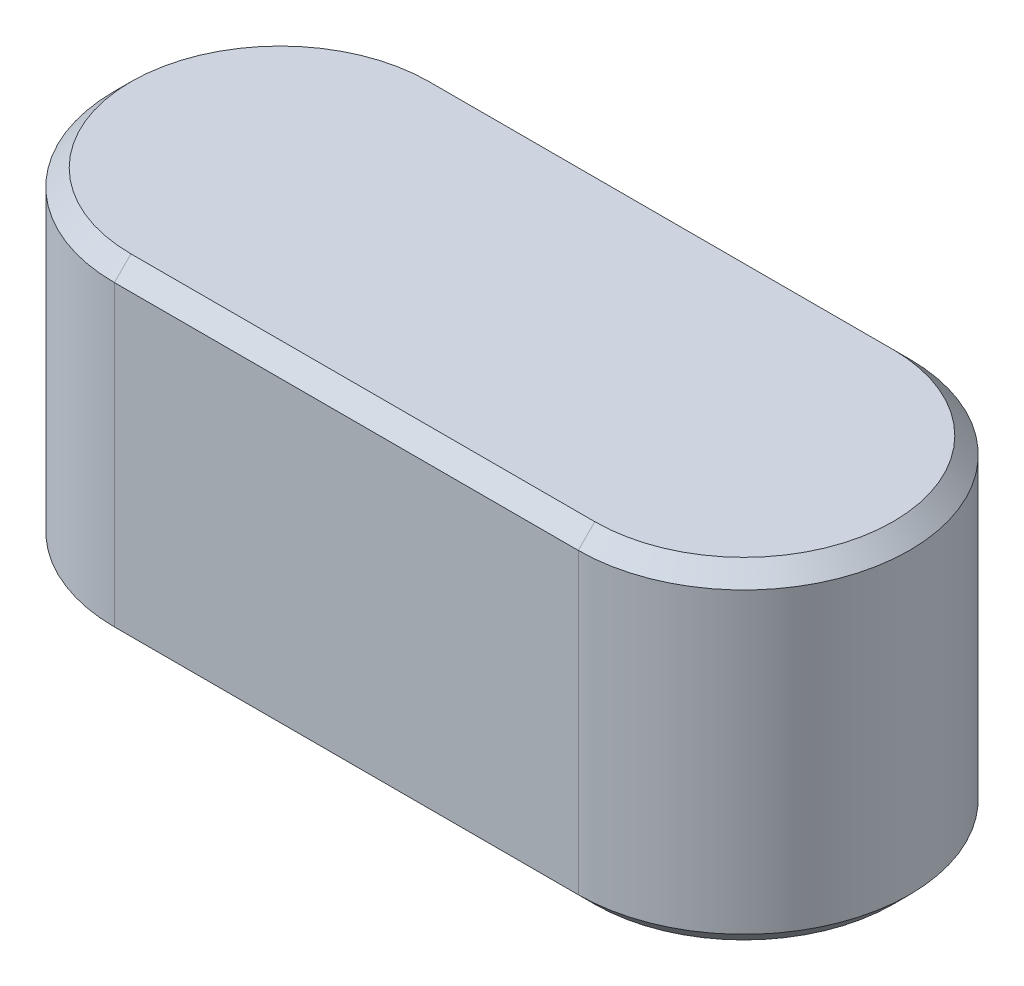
ISO-10303-21;
HEADER;
FILE_DESCRIPTION(('STEP AP214'),'2;1');
FILE_NAME('part.step','',(''),(''),'','','');
FILE_SCHEMA(('AUTOMOTIVE_DESIGN { 1 0 10303 214 1 1 1 1 }'));
ENDSEC;
DATA;
#1=APPLICATION_CONTEXT('core data for automotive mechanical design processes');
#2=APPLICATION_PROTOCOL_DEFINITION('international standard','automotive_design',2000,#1);
#3=PRODUCT_CONTEXT('',#1,'mechanical');
#4=PRODUCT('Part','Part','',(#3));
#5=PRODUCT_RELATED_PRODUCT_CATEGORY('part','',(#4));
#6=PRODUCT_DEFINITION_FORMATION('','',#4);
#7=PRODUCT_DEFINITION_CONTEXT('part definition',#1,'design');
#8=PRODUCT_DEFINITION('design','',#6,#7);
#9=PRODUCT_DEFINITION_SHAPE('','',#8);
#10=(LENGTH_UNIT() NAMED_UNIT(*) SI_UNIT(.MILLI.,.METRE.));
#11=(NAMED_UNIT(*) PLANE_ANGLE_UNIT() SI_UNIT($,.RADIAN.));
#12=(NAMED_UNIT(*) SI_UNIT($,.STERADIAN.) SOLID_ANGLE_UNIT());
#13=UNCERTAINTY_MEASURE_WITH_UNIT(LENGTH_MEASURE(1.E-05),#10,'distance_accuracy_value','');
#14=(GEOMETRIC_REPRESENTATION_CONTEXT(3) GLOBAL_UNCERTAINTY_ASSIGNED_CONTEXT((#13)) GLOBAL_UNIT_ASSIGNED_CONTEXT((#10,
#11,#12)) REPRESENTATION_CONTEXT('',''));
#15=CARTESIAN_POINT('',(0.,0.,0.));
#16=DIRECTION('',(0.,0.,1.));
#17=DIRECTION('',(1.,0.,0.));
#18=AXIS2_PLACEMENT_3D('',#15,#16,#17);
#19=CARTESIAN_POINT('',(0.,5.,0.));
#20=DIRECTION('',(0.,-1.,0.));
#21=DIRECTION('',(0.,0.,-1.));
#22=AXIS2_PLACEMENT_3D('',#19,#20,#21);
#23=CYLINDRICAL_SURFACE('',#22,2.5);
#24=DIRECTION('',(0.,-1.,0.));
#25=VECTOR('',#24,1.);
#26=CARTESIAN_POINT('',(0.,5.,2.5));
#27=LINE('',#26,#25);
#28=CARTESIAN_POINT('',(0.,4.75,2.5));
#29=VERTEX_POINT('',#28);
#30=CARTESIAN_POINT('',(0.,0.250000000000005,2.5));
#31=VERTEX_POINT('',#30);
#32=EDGE_CURVE('E102',#29,#31,#27,.T.);
#33=ORIENTED_EDGE('',*,*,#32,.F.);
#34=CARTESIAN_POINT('',(0.,4.75,0.));
#35=DIRECTION('',(0.,1.,0.));
#36=DIRECTION('',(0.,0.,1.));
#37=AXIS2_PLACEMENT_3D('',#34,#35,#36);
#38=CIRCLE('',#37,2.5);
#39=CARTESIAN_POINT('',(0.,4.75,-2.5));
#40=VERTEX_POINT('',#39);
#41=EDGE_CURVE('E99',#29,#40,#38,.F.);
#42=ORIENTED_EDGE('',*,*,#41,.T.);
#43=DIRECTION('',(0.,-1.,0.));
#44=VECTOR('',#43,1.);
#45=CARTESIAN_POINT('',(0.,5.,-2.5));
#46=LINE('',#45,#44);
#47=CARTESIAN_POINT('',(0.,0.250000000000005,-2.5));
#48=VERTEX_POINT('',#47);
#49=EDGE_CURVE('E101',#40,#48,#46,.T.);
#50=ORIENTED_EDGE('',*,*,#49,.T.);
#51=CARTESIAN_POINT('',(0.,0.250000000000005,0.));
#52=DIRECTION('',(0.,1.,0.));
#53=DIRECTION('',(0.,0.,1.));
#54=AXIS2_PLACEMENT_3D('',#51,#52,#53);
#55=CIRCLE('',#54,2.5);
#56=EDGE_CURVE('E49',#48,#31,#55,.T.);
#57=ORIENTED_EDGE('',*,*,#56,.T.);
#58=EDGE_LOOP('',(#33,#42,#50,#57));
#59=FACE_BOUND('',#58,.T.);
#60=ADVANCED_FACE('F35',(#59),#23,.T.);
#61=CARTESIAN_POINT('',(7.,5.,2.5));
#62=DIRECTION('',(0.,0.,-1.));
#63=DIRECTION('',(-1.,0.,0.));
#64=AXIS2_PLACEMENT_3D('',#61,#62,#63);
#65=PLANE('',#64);
#66=DIRECTION('',(0.,-1.,0.));
#67=VECTOR('',#66,1.);
#68=CARTESIAN_POINT('',(7.,5.,2.5));
#69=LINE('',#68,#67);
#70=CARTESIAN_POINT('',(7.,4.75,2.5));
#71=VERTEX_POINT('',#70);
#72=CARTESIAN_POINT('',(7.,0.250000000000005,2.5));
#73=VERTEX_POINT('',#72);
#74=EDGE_CURVE('E146',#71,#73,#69,.T.);
#75=ORIENTED_EDGE('',*,*,#74,.F.);
#76=DIRECTION('',(-1.,0.,0.));
#77=VECTOR('',#76,1.);
#78=CARTESIAN_POINT('',(0.,4.75,2.5));
#79=LINE('',#78,#77);
#80=EDGE_CURVE('E170',#71,#29,#79,.T.);
#81=ORIENTED_EDGE('',*,*,#80,.T.);
#82=ORIENTED_EDGE('',*,*,#32,.T.);
#83=DIRECTION('',(1.,0.,0.));
#84=VECTOR('',#83,1.);
#85=CARTESIAN_POINT('',(7.,0.250000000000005,2.5));
#86=LINE('',#85,#84);
#87=EDGE_CURVE('E168',#31,#73,#86,.T.);
#88=ORIENTED_EDGE('',*,*,#87,.T.);
#89=EDGE_LOOP('',(#75,#81,#82,#88));
#90=FACE_BOUND('',#89,.T.);
#91=ADVANCED_FACE('F194',(#90),#65,.F.);
#92=CARTESIAN_POINT('',(7.,5.,0.));
#93=DIRECTION('',(0.,-1.,0.));
#94=DIRECTION('',(0.,0.,-1.));
#95=AXIS2_PLACEMENT_3D('',#92,#93,#94);
#96=CYLINDRICAL_SURFACE('',#95,2.5);
#97=DIRECTION('',(0.,-1.,0.));
#98=VECTOR('',#97,1.);
#99=CARTESIAN_POINT('',(7.,5.,-2.5));
#100=LINE('',#99,#98);
#101=CARTESIAN_POINT('',(7.,4.75,-2.5));
#102=VERTEX_POINT('',#101);
#103=CARTESIAN_POINT('',(7.,0.250000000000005,-2.5));
#104=VERTEX_POINT('',#103);
#105=EDGE_CURVE('E116',#102,#104,#100,.T.);
#106=ORIENTED_EDGE('',*,*,#105,.F.);
#107=CARTESIAN_POINT('',(7.,4.75,0.));
#108=DIRECTION('',(0.,1.,0.));
#109=DIRECTION('',(0.,0.,1.));
#110=AXIS2_PLACEMENT_3D('',#107,#108,#109);
#111=CIRCLE('',#110,2.5);
#112=EDGE_CURVE('E11',#102,#71,#111,.F.);
#113=ORIENTED_EDGE('',*,*,#112,.T.);
#114=ORIENTED_EDGE('',*,*,#74,.T.);
#115=CARTESIAN_POINT('',(7.,0.250000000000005,0.));
#116=DIRECTION('',(0.,1.,0.));
#117=DIRECTION('',(0.,0.,1.));
#118=AXIS2_PLACEMENT_3D('',#115,#116,#117);
#119=CIRCLE('',#118,2.5);
#120=EDGE_CURVE('E42',#73,#104,#119,.T.);
#121=ORIENTED_EDGE('',*,*,#120,.T.);
#122=EDGE_LOOP('',(#106,#113,#114,#121));
#123=FACE_BOUND('',#122,.T.);
#124=ADVANCED_FACE('F174',(#123),#96,.T.);
#125=CARTESIAN_POINT('',(7.,5.,-2.5));
#126=DIRECTION('',(0.,0.,1.));
#127=DIRECTION('',(1.,0.,0.));
#128=AXIS2_PLACEMENT_3D('',#125,#126,#127);
#129=PLANE('',#128);
#130=ORIENTED_EDGE('',*,*,#105,.T.);
#131=DIRECTION('',(-1.,0.,0.));
#132=VECTOR('',#131,1.);
#133=CARTESIAN_POINT('',(7.,0.250000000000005,-2.5));
#134=LINE('',#133,#132);
#135=EDGE_CURVE('E115',#104,#48,#134,.T.);
#136=ORIENTED_EDGE('',*,*,#135,.T.);
#137=ORIENTED_EDGE('',*,*,#49,.F.);
#138=DIRECTION('',(1.,0.,0.));
#139=VECTOR('',#138,1.);
#140=CARTESIAN_POINT('',(7.,4.75,-2.5));
#141=LINE('',#140,#139);
#142=EDGE_CURVE('E112',#40,#102,#141,.T.);
#143=ORIENTED_EDGE('',*,*,#142,.T.);
#144=EDGE_LOOP('',(#130,#136,#137,#143));
#145=FACE_BOUND('',#144,.T.);
#146=ADVANCED_FACE('F111',(#145),#129,.F.);
#147=CARTESIAN_POINT('',(0.,5.,0.));
#148=DIRECTION('',(0.,1.,0.));
#149=DIRECTION('',(0.,0.,1.));
#150=AXIS2_PLACEMENT_3D('',#147,#148,#149);
#151=PLANE('',#150);
#152=CARTESIAN_POINT('',(0.,5.,0.));
#153=DIRECTION('',(0.,1.,0.));
#154=DIRECTION('',(0.,0.,1.));
#155=AXIS2_PLACEMENT_3D('',#152,#153,#154);
#156=CIRCLE('',#155,2.25);
#157=CARTESIAN_POINT('',(0.,5.,-2.24999999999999));
#158=VERTEX_POINT('',#157);
#159=CARTESIAN_POINT('',(0.,5.,2.25));
#160=VERTEX_POINT('',#159);
#161=EDGE_CURVE('E131',#158,#160,#156,.T.);
#162=ORIENTED_EDGE('',*,*,#161,.T.);
#163=DIRECTION('',(1.,0.,0.));
#164=VECTOR('',#163,1.);
#165=CARTESIAN_POINT('',(7.,5.,2.25));
#166=LINE('',#165,#164);
#167=CARTESIAN_POINT('',(7.,5.,2.25));
#168=VERTEX_POINT('',#167);
#169=EDGE_CURVE('E165',#160,#168,#166,.T.);
#170=ORIENTED_EDGE('',*,*,#169,.T.);
#171=CARTESIAN_POINT('',(7.,5.,0.));
#172=DIRECTION('',(0.,1.,0.));
#173=DIRECTION('',(0.,0.,1.));
#174=AXIS2_PLACEMENT_3D('',#171,#172,#173);
#175=CIRCLE('',#174,2.25);
#176=CARTESIAN_POINT('',(7.,5.,-2.25));
#177=VERTEX_POINT('',#176);
#178=EDGE_CURVE('E160',#168,#177,#175,.T.);
#179=ORIENTED_EDGE('',*,*,#178,.T.);
#180=DIRECTION('',(-1.,0.,0.));
#181=VECTOR('',#180,1.);
#182=CARTESIAN_POINT('',(0.,5.,-2.24999999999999));
#183=LINE('',#182,#181);
#184=EDGE_CURVE('E162',#177,#158,#183,.T.);
#185=ORIENTED_EDGE('',*,*,#184,.T.);
#186=EDGE_LOOP('',(#162,#170,#179,#185));
#187=FACE_BOUND('',#186,.T.);
#188=ADVANCED_FACE('F203',(#187),#151,.T.);
#189=CARTESIAN_POINT('',(0.,0.,0.));
#190=DIRECTION('',(0.,1.,0.));
#191=DIRECTION('',(0.,0.,1.));
#192=AXIS2_PLACEMENT_3D('',#189,#190,#191);
#193=PLANE('',#192);
#194=DIRECTION('',(-1.,0.,0.));
#195=VECTOR('',#194,1.);
#196=CARTESIAN_POINT('',(0.,0.,2.25));
#197=LINE('',#196,#195);
#198=CARTESIAN_POINT('',(7.,0.,2.25));
#199=VERTEX_POINT('',#198);
#200=CARTESIAN_POINT('',(0.,0.,2.25));
#201=VERTEX_POINT('',#200);
#202=EDGE_CURVE('E153',#199,#201,#197,.T.);
#203=ORIENTED_EDGE('',*,*,#202,.T.);
#204=CARTESIAN_POINT('',(0.,0.,0.));
#205=DIRECTION('',(0.,1.,0.));
#206=DIRECTION('',(0.,0.,1.));
#207=AXIS2_PLACEMENT_3D('',#204,#205,#206);
#208=CIRCLE('',#207,2.25);
#209=CARTESIAN_POINT('',(0.,0.,-2.25));
#210=VERTEX_POINT('',#209);
#211=EDGE_CURVE('E158',#201,#210,#208,.F.);
#212=ORIENTED_EDGE('',*,*,#211,.T.);
#213=DIRECTION('',(1.,0.,0.));
#214=VECTOR('',#213,1.);
#215=CARTESIAN_POINT('',(0.,0.,-2.25));
#216=LINE('',#215,#214);
#217=CARTESIAN_POINT('',(7.,0.,-2.25));
#218=VERTEX_POINT('',#217);
#219=EDGE_CURVE('E155',#210,#218,#216,.T.);
#220=ORIENTED_EDGE('',*,*,#219,.T.);
#221=CARTESIAN_POINT('',(7.,0.,0.));
#222=DIRECTION('',(0.,1.,0.));
#223=DIRECTION('',(0.,0.,1.));
#224=AXIS2_PLACEMENT_3D('',#221,#222,#223);
#225=CIRCLE('',#224,2.25);
#226=EDGE_CURVE('E151',#218,#199,#225,.F.);
#227=ORIENTED_EDGE('',*,*,#226,.T.);
#228=EDGE_LOOP('',(#203,#212,#220,#227));
#229=FACE_BOUND('',#228,.T.);
#230=ADVANCED_FACE('F205',(#229),#193,.F.);
#231=CARTESIAN_POINT('',(7.,0.250000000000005,2.5));
#232=DIRECTION('',(0.,0.707106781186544,-0.707106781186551));
#233=DIRECTION('',(0.,0.707106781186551,0.707106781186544));
#234=AXIS2_PLACEMENT_3D('',#231,#232,#233);
#235=PLANE('',#234);
#236=DIRECTION('',(0.,0.707106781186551,0.707106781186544));
#237=VECTOR('',#236,1.);
#238=CARTESIAN_POINT('',(0.,0.,2.25));
#239=LINE('',#238,#237);
#240=EDGE_CURVE('E140',#201,#31,#239,.T.);
#241=ORIENTED_EDGE('',*,*,#240,.F.);
#242=ORIENTED_EDGE('',*,*,#202,.F.);
#243=DIRECTION('',(0.,-0.707106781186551,-0.707106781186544));
#244=VECTOR('',#243,1.);
#245=CARTESIAN_POINT('',(7.,0.250000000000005,2.5));
#246=LINE('',#245,#244);
#247=EDGE_CURVE('E117',#73,#199,#246,.T.);
#248=ORIENTED_EDGE('',*,*,#247,.F.);
#249=ORIENTED_EDGE('',*,*,#87,.F.);
#250=EDGE_LOOP('',(#241,#242,#248,#249));
#251=FACE_BOUND('',#250,.T.);
#252=ADVANCED_FACE('F192',(#251),#235,.F.);
#253=CARTESIAN_POINT('',(7.,0.250000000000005,0.));
#254=DIRECTION('',(0.,1.,0.));
#255=DIRECTION('',(0.,0.,1.));
#256=AXIS2_PLACEMENT_3D('',#253,#254,#255);
#257=CONICAL_SURFACE('',#256,2.5,0.785398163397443);
#258=ORIENTED_EDGE('',*,*,#247,.T.);
#259=ORIENTED_EDGE('',*,*,#226,.F.);
#260=DIRECTION('',(0.,-0.707106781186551,0.707106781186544));
#261=VECTOR('',#260,1.);
#262=CARTESIAN_POINT('',(7.,0.250000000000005,-2.5));
#263=LINE('',#262,#261);
#264=EDGE_CURVE('E134',#104,#218,#263,.T.);
#265=ORIENTED_EDGE('',*,*,#264,.F.);
#266=ORIENTED_EDGE('',*,*,#120,.F.);
#267=EDGE_LOOP('',(#258,#259,#265,#266));
#268=FACE_BOUND('',#267,.T.);
#269=ADVANCED_FACE('F180',(#268),#257,.T.);
#270=CARTESIAN_POINT('',(0.,0.250000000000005,0.));
#271=DIRECTION('',(0.,1.,0.));
#272=DIRECTION('',(0.,0.,1.));
#273=AXIS2_PLACEMENT_3D('',#270,#271,#272);
#274=CONICAL_SURFACE('',#273,2.5,0.785398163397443);
#275=ORIENTED_EDGE('',*,*,#240,.T.);
#276=ORIENTED_EDGE('',*,*,#56,.F.);
#277=DIRECTION('',(0.,0.707106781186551,-0.707106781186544));
#278=VECTOR('',#277,1.);
#279=CARTESIAN_POINT('',(0.,0.,-2.25));
#280=LINE('',#279,#278);
#281=EDGE_CURVE('E132',#210,#48,#280,.T.);
#282=ORIENTED_EDGE('',*,*,#281,.F.);
#283=ORIENTED_EDGE('',*,*,#211,.F.);
#284=EDGE_LOOP('',(#275,#276,#282,#283));
#285=FACE_BOUND('',#284,.T.);
#286=ADVANCED_FACE('F187',(#285),#274,.T.);
#287=CARTESIAN_POINT('',(7.,0.250000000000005,-2.5));
#288=DIRECTION('',(0.,0.707106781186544,0.707106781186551));
#289=DIRECTION('',(0.,-0.707106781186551,0.707106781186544));
#290=AXIS2_PLACEMENT_3D('',#287,#288,#289);
#291=PLANE('',#290);
#292=ORIENTED_EDGE('',*,*,#264,.T.);
#293=ORIENTED_EDGE('',*,*,#219,.F.);
#294=ORIENTED_EDGE('',*,*,#281,.T.);
#295=ORIENTED_EDGE('',*,*,#135,.F.);
#296=EDGE_LOOP('',(#292,#293,#294,#295));
#297=FACE_BOUND('',#296,.T.);
#298=ADVANCED_FACE('F183',(#297),#291,.F.);
#299=CARTESIAN_POINT('',(0.,5.,-2.24999999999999));
#300=DIRECTION('',(0.,0.707106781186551,-0.707106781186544));
#301=DIRECTION('',(0.,0.707106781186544,0.707106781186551));
#302=AXIS2_PLACEMENT_3D('',#299,#300,#301);
#303=PLANE('',#302);
#304=DIRECTION('',(0.,0.707106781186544,0.707106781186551));
#305=VECTOR('',#304,1.);
#306=CARTESIAN_POINT('',(7.,4.75,-2.5));
#307=LINE('',#306,#305);
#308=EDGE_CURVE('E127',#102,#177,#307,.T.);
#309=ORIENTED_EDGE('',*,*,#308,.F.);
#310=ORIENTED_EDGE('',*,*,#142,.F.);
#311=DIRECTION('',(0.,-0.707106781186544,-0.707106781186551));
#312=VECTOR('',#311,1.);
#313=CARTESIAN_POINT('',(0.,5.,-2.24999999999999));
#314=LINE('',#313,#312);
#315=EDGE_CURVE('E124',#158,#40,#314,.T.);
#316=ORIENTED_EDGE('',*,*,#315,.F.);
#317=ORIENTED_EDGE('',*,*,#184,.F.);
#318=EDGE_LOOP('',(#309,#310,#316,#317));
#319=FACE_BOUND('',#318,.T.);
#320=ADVANCED_FACE('F122',(#319),#303,.T.);
#321=CARTESIAN_POINT('',(0.,5.,0.));
#322=DIRECTION('',(0.,-1.,0.));
#323=DIRECTION('',(0.,0.,-1.));
#324=AXIS2_PLACEMENT_3D('',#321,#322,#323);
#325=CONICAL_SURFACE('',#324,2.25,0.785398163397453);
#326=ORIENTED_EDGE('',*,*,#315,.T.);
#327=ORIENTED_EDGE('',*,*,#41,.F.);
#328=DIRECTION('',(0.,-0.707106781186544,0.707106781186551));
#329=VECTOR('',#328,1.);
#330=CARTESIAN_POINT('',(0.,5.,2.25));
#331=LINE('',#330,#329);
#332=EDGE_CURVE('E57',#160,#29,#331,.T.);
#333=ORIENTED_EDGE('',*,*,#332,.F.);
#334=ORIENTED_EDGE('',*,*,#161,.F.);
#335=EDGE_LOOP('',(#326,#327,#333,#334));
#336=FACE_BOUND('',#335,.T.);
#337=ADVANCED_FACE('F130',(#336),#325,.T.);
#338=CARTESIAN_POINT('',(7.,5.,0.));
#339=DIRECTION('',(0.,-1.,0.));
#340=DIRECTION('',(0.,0.,-1.));
#341=AXIS2_PLACEMENT_3D('',#338,#339,#340);
#342=CONICAL_SURFACE('',#341,2.25,0.785398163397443);
#343=ORIENTED_EDGE('',*,*,#308,.T.);
#344=ORIENTED_EDGE('',*,*,#178,.F.);
#345=DIRECTION('',(0.,0.707106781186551,-0.707106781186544));
#346=VECTOR('',#345,1.);
#347=CARTESIAN_POINT('',(7.,4.75,2.5));
#348=LINE('',#347,#346);
#349=EDGE_CURVE('E197',#71,#168,#348,.T.);
#350=ORIENTED_EDGE('',*,*,#349,.F.);
#351=ORIENTED_EDGE('',*,*,#112,.F.);
#352=EDGE_LOOP('',(#343,#344,#350,#351));
#353=FACE_BOUND('',#352,.T.);
#354=ADVANCED_FACE('F200',(#353),#342,.T.);
#355=CARTESIAN_POINT('',(0.,5.,2.25));
#356=DIRECTION('',(0.,0.707106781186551,0.707106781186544));
#357=DIRECTION('',(0.,-0.707106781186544,0.707106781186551));
#358=AXIS2_PLACEMENT_3D('',#355,#356,#357);
#359=PLANE('',#358);
#360=ORIENTED_EDGE('',*,*,#332,.T.);
#361=ORIENTED_EDGE('',*,*,#80,.F.);
#362=ORIENTED_EDGE('',*,*,#349,.T.);
#363=ORIENTED_EDGE('',*,*,#169,.F.);
#364=EDGE_LOOP('',(#360,#361,#362,#363));
#365=FACE_BOUND('',#364,.T.);
#366=ADVANCED_FACE('F196',(#365),#359,.T.);
#367=CLOSED_SHELL('',(#60,#91,#124,#146,#188,#230,#252,#269,#286,#298,#320,#337,#354,#366));
#368=MANIFOLD_SOLID_BREP('B2',#367);
#369=ADVANCED_BREP_SHAPE_REPRESENTATION('',(#18,#368),#14);
#370=SHAPE_DEFINITION_REPRESENTATION(#9,#369);
ENDSEC;
END-ISO-10303-21;
